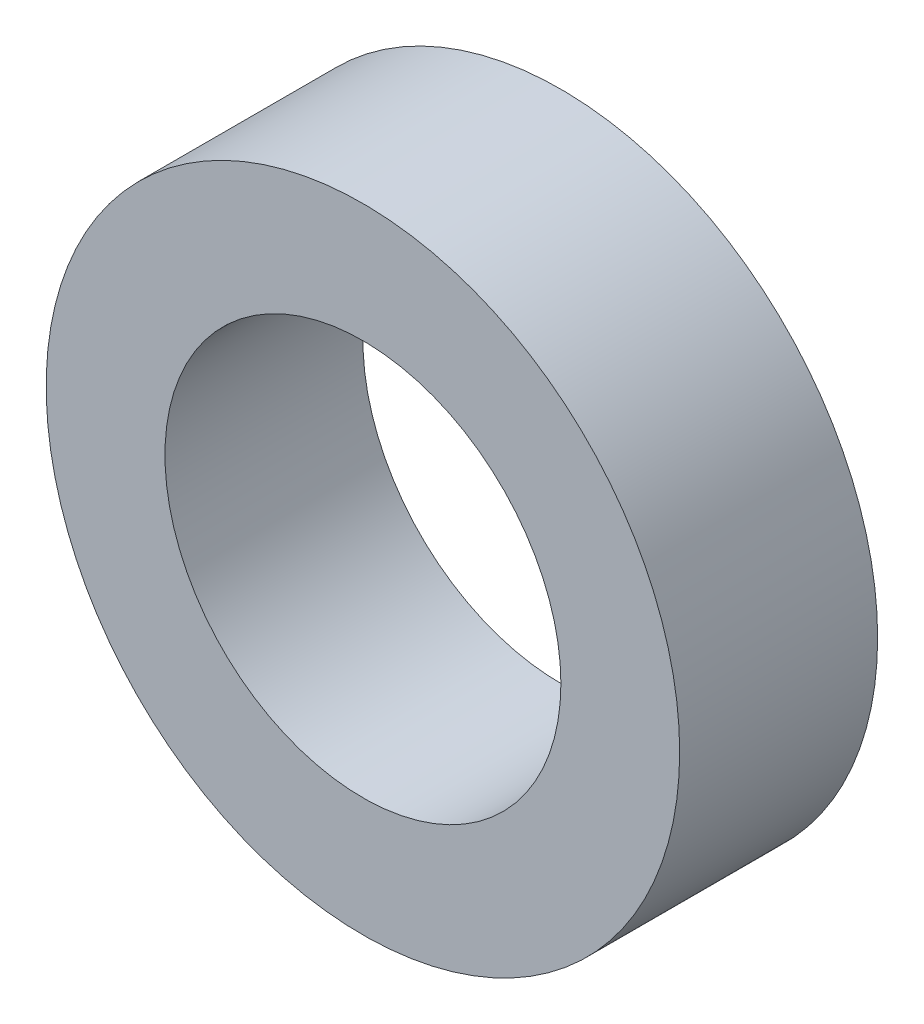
ISO-10303-21;
HEADER;
FILE_DESCRIPTION(('STEP AP214'),'2;1');
FILE_NAME('part.step','',(''),(''),'','','');
FILE_SCHEMA(('AUTOMOTIVE_DESIGN { 1 0 10303 214 1 1 1 1 }'));
ENDSEC;
DATA;
#1=APPLICATION_CONTEXT('core data for automotive mechanical design processes');
#2=APPLICATION_PROTOCOL_DEFINITION('international standard','automotive_design',2000,#1);
#3=PRODUCT_CONTEXT('',#1,'mechanical');
#4=PRODUCT('Part','Part','',(#3));
#5=PRODUCT_RELATED_PRODUCT_CATEGORY('part','',(#4));
#6=PRODUCT_DEFINITION_FORMATION('','',#4);
#7=PRODUCT_DEFINITION_CONTEXT('part definition',#1,'design');
#8=PRODUCT_DEFINITION('design','',#6,#7);
#9=PRODUCT_DEFINITION_SHAPE('','',#8);
#10=(LENGTH_UNIT() NAMED_UNIT(*) SI_UNIT(.MILLI.,.METRE.));
#11=(NAMED_UNIT(*) PLANE_ANGLE_UNIT() SI_UNIT($,.RADIAN.));
#12=(NAMED_UNIT(*) SI_UNIT($,.STERADIAN.) SOLID_ANGLE_UNIT());
#13=UNCERTAINTY_MEASURE_WITH_UNIT(LENGTH_MEASURE(1.E-05),#10,'distance_accuracy_value','');
#14=(GEOMETRIC_REPRESENTATION_CONTEXT(3) GLOBAL_UNCERTAINTY_ASSIGNED_CONTEXT((#13)) GLOBAL_UNIT_ASSIGNED_CONTEXT((#10,
#11,#12)) REPRESENTATION_CONTEXT('',''));
#15=CARTESIAN_POINT('',(0.,0.,0.));
#16=DIRECTION('',(0.,0.,1.));
#17=DIRECTION('',(1.,0.,0.));
#18=AXIS2_PLACEMENT_3D('',#15,#16,#17);
#19=CARTESIAN_POINT('',(0.,0.,5.));
#20=DIRECTION('',(0.,0.,1.));
#21=DIRECTION('',(1.,0.,0.));
#22=AXIS2_PLACEMENT_3D('',#19,#20,#21);
#23=PLANE('',#22);
#24=CARTESIAN_POINT('',(0.,0.,5.));
#25=DIRECTION('',(0.,0.,1.));
#26=DIRECTION('',(1.,0.,0.));
#27=AXIS2_PLACEMENT_3D('',#24,#25,#26);
#28=CIRCLE('',#27,8.);
#29=CARTESIAN_POINT('',(8.,0.,5.));
#30=VERTEX_POINT('',#29);
#31=EDGE_CURVE('E10',#30,#30,#28,.T.);
#32=ORIENTED_EDGE('',*,*,#31,.T.);
#33=EDGE_LOOP('',(#32));
#34=FACE_BOUND('',#33,.T.);
#35=CARTESIAN_POINT('',(0.,0.,5.));
#36=DIRECTION('',(0.,0.,1.));
#37=DIRECTION('',(1.,0.,0.));
#38=AXIS2_PLACEMENT_3D('',#35,#36,#37);
#39=CIRCLE('',#38,5.);
#40=CARTESIAN_POINT('',(5.,0.,5.));
#41=VERTEX_POINT('',#40);
#42=EDGE_CURVE('E39',#41,#41,#39,.T.);
#43=ORIENTED_EDGE('',*,*,#42,.F.);
#44=EDGE_LOOP('',(#43));
#45=FACE_BOUND('',#44,.T.);
#46=ADVANCED_FACE('F28',(#34,#45),#23,.T.);
#47=CARTESIAN_POINT('',(0.,0.,0.));
#48=DIRECTION('',(0.,0.,1.));
#49=DIRECTION('',(1.,0.,0.));
#50=AXIS2_PLACEMENT_3D('',#47,#48,#49);
#51=PLANE('',#50);
#52=CARTESIAN_POINT('',(0.,0.,0.));
#53=DIRECTION('',(0.,0.,1.));
#54=DIRECTION('',(1.,0.,0.));
#55=AXIS2_PLACEMENT_3D('',#52,#53,#54);
#56=CIRCLE('',#55,8.);
#57=CARTESIAN_POINT('',(8.,0.,0.));
#58=VERTEX_POINT('',#57);
#59=EDGE_CURVE('E32',#58,#58,#56,.T.);
#60=ORIENTED_EDGE('',*,*,#59,.F.);
#61=EDGE_LOOP('',(#60));
#62=FACE_BOUND('',#61,.T.);
#63=CARTESIAN_POINT('',(0.,0.,0.));
#64=DIRECTION('',(0.,0.,1.));
#65=DIRECTION('',(1.,0.,0.));
#66=AXIS2_PLACEMENT_3D('',#63,#64,#65);
#67=CIRCLE('',#66,5.);
#68=CARTESIAN_POINT('',(5.,0.,0.));
#69=VERTEX_POINT('',#68);
#70=EDGE_CURVE('E41',#69,#69,#67,.T.);
#71=ORIENTED_EDGE('',*,*,#70,.T.);
#72=EDGE_LOOP('',(#71));
#73=FACE_BOUND('',#72,.T.);
#74=ADVANCED_FACE('F51',(#62,#73),#51,.F.);
#75=CARTESIAN_POINT('',(0.,0.,5.));
#76=DIRECTION('',(0.,0.,-1.));
#77=DIRECTION('',(-1.,0.,0.));
#78=AXIS2_PLACEMENT_3D('',#75,#76,#77);
#79=CYLINDRICAL_SURFACE('',#78,8.);
#80=ORIENTED_EDGE('',*,*,#31,.F.);
#81=EDGE_LOOP('',(#80));
#82=FACE_BOUND('',#81,.T.);
#83=ORIENTED_EDGE('',*,*,#59,.T.);
#84=EDGE_LOOP('',(#83));
#85=FACE_BOUND('',#84,.T.);
#86=ADVANCED_FACE('F30',(#82,#85),#79,.T.);
#87=CARTESIAN_POINT('',(0.,0.,5.));
#88=DIRECTION('',(0.,0.,-1.));
#89=DIRECTION('',(-1.,0.,0.));
#90=AXIS2_PLACEMENT_3D('',#87,#88,#89);
#91=CYLINDRICAL_SURFACE('',#90,5.);
#92=ORIENTED_EDGE('',*,*,#42,.T.);
#93=EDGE_LOOP('',(#92));
#94=FACE_BOUND('',#93,.T.);
#95=ORIENTED_EDGE('',*,*,#70,.F.);
#96=EDGE_LOOP('',(#95));
#97=FACE_BOUND('',#96,.T.);
#98=ADVANCED_FACE('F47',(#94,#97),#91,.F.);
#99=CLOSED_SHELL('',(#46,#74,#86,#98));
#100=MANIFOLD_SOLID_BREP('B2',#99);
#101=ADVANCED_BREP_SHAPE_REPRESENTATION('',(#18,#100),#14);
#102=SHAPE_DEFINITION_REPRESENTATION(#9,#101);
ENDSEC;
END-ISO-10303-21;
